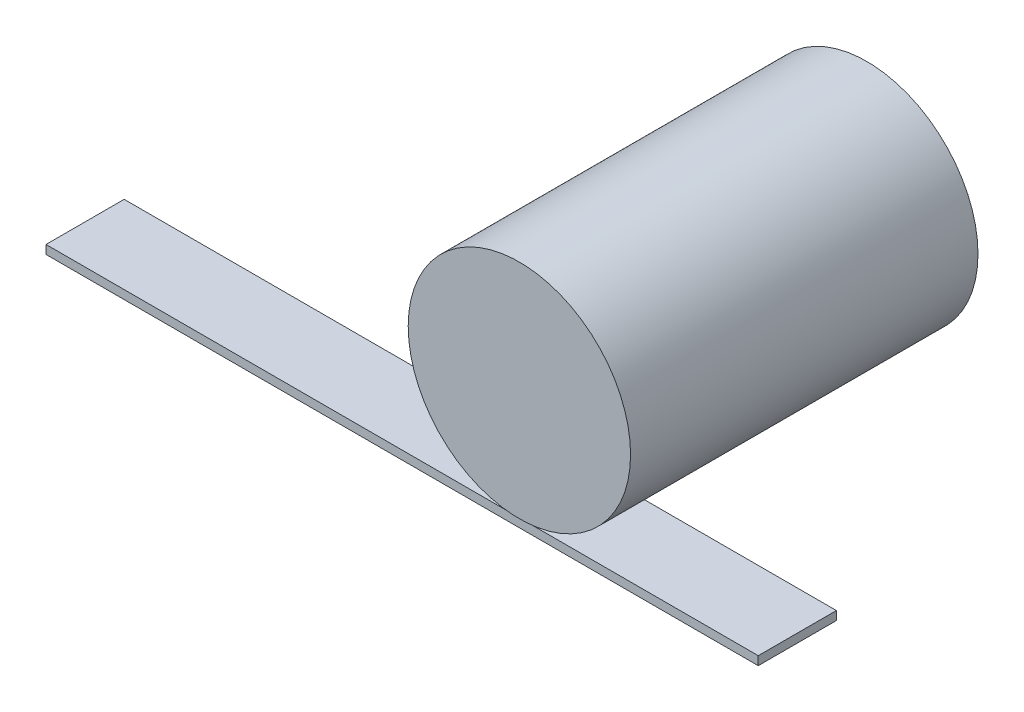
from build123d import *

# Parameters (mm, degrees)
BOSS_EXTRU_1_DEPTH      = 70
BOSS_EXTRU_1_DEPTH_BACK = 130
ESQUISSE1_R             = 64
ESQUISSE2_W             = 410
ESQUISSE2_H             = 45
BOSS_EXTRU_2_DEPTH      = 5


with BuildPart() as part:
    # Esquisse1 → Boss.-Extru.1 (new, two sides: drawn at the far end of the back side and taken through both)
    with BuildSketch(Plane.XY.offset(-BOSS_EXTRU_1_DEPTH_BACK)):
        Circle(ESQUISSE1_R)
    extrude(amount=BOSS_EXTRU_1_DEPTH + BOSS_EXTRU_1_DEPTH_BACK)


with BuildPart() as body_2:
    # Esquisse2 → Boss.-Extru.2 (new body)
    with BuildSketch(Plane(origin=(0, -91, 0), x_dir=(1, 0, 0), z_dir=(0, 1, 0))):
        with Locations((-95, -20)):
            Rectangle(ESQUISSE2_W, ESQUISSE2_H)
    extrude(amount=-BOSS_EXTRU_2_DEPTH)


solid = Compound([part.part, body_2.part])
